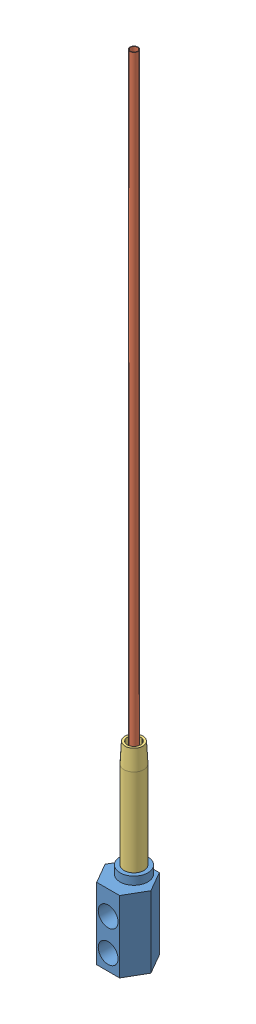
SolidWorks assembly HFC1616.sldasm, configuration Default (file format 11000). Lengths in mm.
Overall size (18.33 314.2 15.88).
3 component instances, 3 part files, 4 mates.
Components (placement in the parent):
- HFH1616-1: HFH1616.sldprt [Default] at (0 0 -5.5499) x (0 1 0) z (0 0 1) size (31.75 18.33 15.88)
- HFT125L12-1: HFT125L12.sldprt [Default] at (0 9.398 0) size (4.83 304.8 4.83)
- GPN06L2-1: GPN06L2.sldprt [Default] at (0 74.6128 0) x (0 -1 0) z (0 0 1) size (50.8 7.94 7.94)
Mates (geometry in assembly coordinates):
- Concentric9: concentric: cylinder of HFH1616-1 through (0 20.6378 0) axis (0 1 0) radius 2.6543; circle of HFT125L12-1
- Coincident23: coincident: plane of HFH1616-1 through (0 9.398 -2.2145) normal (0 1 0); plane of HFT125L12-1 through (-1.3843 9.398 0) normal (0 -1 0)
- Concentric10: concentric: cylinder of HFH1616-1 through (0 31.75 0) axis (0 1 0) radius 5.5499; circle of GPN06L2-1
- Coincident24: coincident: plane of HFH1616-1 through (0 23.8128 -3.5525) normal (0 1 0); plane of GPN06L2-1 through (2.6543 23.8128 0) normal (0 -1 0)
